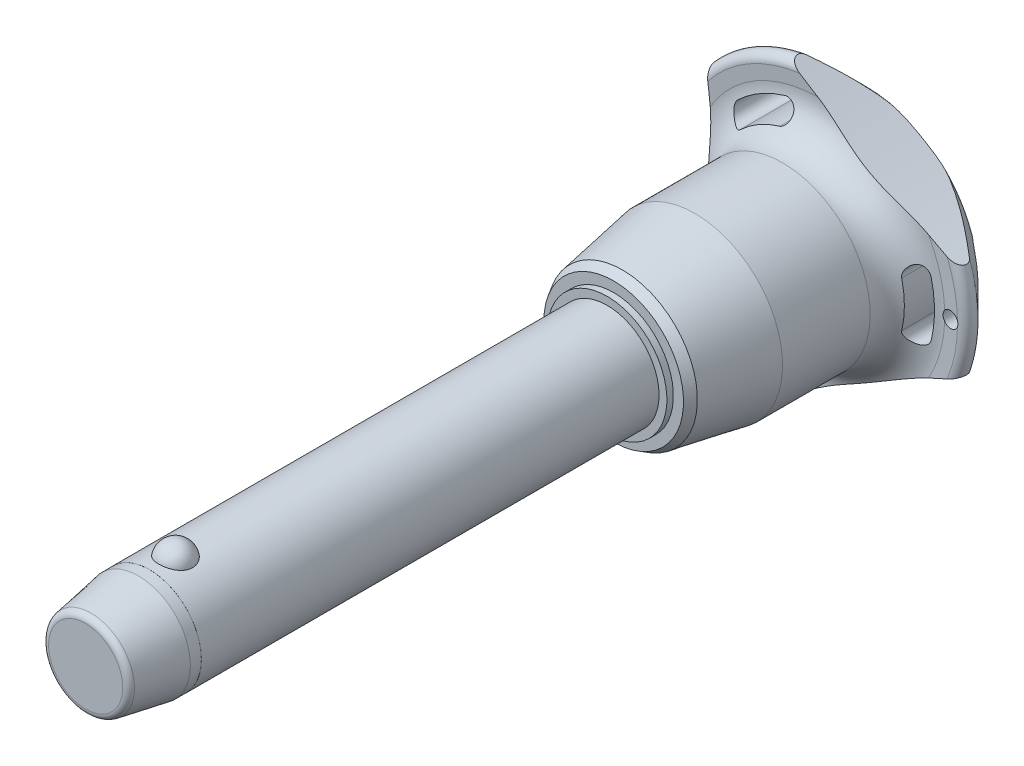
from build123d import *

# Parameters (mm, degrees)
SKETCH1_R           = 10
BOSS_EXTRUDE1_DEPTH = 80
SKETCH2_R           = 8.75
BOSS_EXTRUDE2_DEPTH = 50.7
BOSS_EXTRUDE3_START = 20.5
SKETCH1_2_R         = 10
BOSS_EXTRUDE3_DEPTH = 20.5
CHAMFER1_SIZE       = 10.25
CHAMFER1_SIZE2      = 1.807351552
FILLET1_R           = 1.25
SKETCH6_R           = 176.92625
CUT_EXTRUDE1_DEPTH  = 137.79481676
CIRPATTERN1_COUNT   = 3
SKETCH7_R           = 1.5
CUT_EXTRUDE2_DEPTH  = 137.683489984
SKETCH8_R           = 10
SKETCH8_R_2         = 9.99
CUT_EXTRUDE3_DEPTH  = 12.3


with BuildPart() as part:
    # Sketch1 → Boss-Extrude1 (new body)
    with BuildSketch(Plane.XY):
        Circle(SKETCH1_R)
    extrude(amount=-BOSS_EXTRUDE1_DEPTH)

    # Sketch2 → Boss-Extrude2 (add)
    with BuildSketch(Plane(origin=(0, 0, -80), x_dir=(-1, 0, 0), z_dir=(0, 0, -1))):
        with Locations(Location((0, 0, 0), (0, 0, 180))):
            Circle(SKETCH2_R)
    extrude(amount=BOSS_EXTRUDE2_DEPTH)

    # Sketch3 → Revolve1 (revolve)
    with BuildSketch(Plane(origin=(0, 0, 0), x_dir=(0, 0, -1), z_dir=(1, 0, 0))):
        with BuildLine():
            Line((-3.201562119, 12.5), (-3.201562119, 5.9))
            ThreePointArc((-3.201562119, 5.9), (0.098437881, 9.2), (-3.201562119, 12.5))
        make_face()
        with BuildLine():
            Line((-3.201562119, -5.9), (-3.201562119, -12.5))
            ThreePointArc((-3.201562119, -12.5), (0.098437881, -9.2), (-3.201562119, -5.9))
        make_face()
    revolve(axis=Axis((0, -5.9, 3.201562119), (0, 1, 0)))

    # Sketch1_2 → Boss-Extrude3 (add)
    with BuildSketch(Plane.XY.offset(BOSS_EXTRUDE3_START)):
        Circle(SKETCH1_2_R)
    extrude(amount=-BOSS_EXTRUDE3_DEPTH)

    # Chamfer1
    chamfer1_edges = [part.edges().sort_by_distance(p)[0] for p in [
        (-10, 0, 20.5),
    ]]
    chamfer1_side = [part.faces().sort_by_distance(p)[0] for p in [
        (-10, 0, -29.75),
    ]]
    chamfer(chamfer1_edges, length=CHAMFER1_SIZE, length2=CHAMFER1_SIZE2, reference=chamfer1_side[0])

    # Fillet1
    fillet1_edges = [part.edges().sort_by_distance(p)[0] for p in [
        (-8.192648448, 0, 20.5),
        (-8.75, 0, -130.7),
    ]]
    fillet(fillet1_edges, radius=FILLET1_R)

    # Sketch4 → Revolve2 (revolve)
    with BuildSketch(Plane(origin=(0, 0, 0), x_dir=(0, 0, -1), z_dir=(1, 0, 0)), mode=Mode.PRIVATE) as revolve2_sk:
        Polygon((80, 0), (80, 11.504815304), (81.25, 11.504815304), (81.25, 13.461079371), (82.944174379, 14.439211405), (96.9, 16.9), (113.8, 16.9), (113.8, 0), align=None)
    revolve(revolve2_sk.sketch.rotate(Axis((0, 0, -113.8), (0, 0, 1)), 90), axis=Axis((0, 0, -113.8), (0, 0, 1)))

    # Sketch5 → Revolve3 (revolve)
    with BuildSketch(Plane(origin=(0, 0, 0), x_dir=(0, 0, -1), z_dir=(1, 0, 0)), mode=Mode.PRIVATE) as revolve3_sk:
        with BuildLine():
            Line((120.790129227, 24.271609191), (120.652256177, 26.865060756))
            ThreePointArc((120.652256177, 26.865060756), (121.598671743, 28.411427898), (123.38137085, 28.08137085))
            Line((123.38137085, 28.08137085), (129.763226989, 21.69951471))
            ThreePointArc((129.763226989, 21.69951471), (130.7, 19.381044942), (129.683055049, 17.096604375))
            ThreePointArc((129.683055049, 17.096604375), (124.18864484, 9.321268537), (122.25, 0))
            Line((122.25, 0), (113.8, 0))
            Line((113.8, 0), (113.8, 16.9))
            ThreePointArc((113.8, 16.9), (118.879432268, 19.083427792), (120.790129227, 24.271609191))
        make_face()
    revolve(revolve3_sk.sketch.rotate(Axis((0, 0, -122.25), (0, 0, 1)), 90), axis=Axis((0, 0, -122.25), (0, 0, 1)))

    # Sketch6 → Cut-Extrude1 (cut, through all)
    with BuildSketch(Plane.XY):
        with Locations((-197.42625, 0)):
            Circle(SKETCH6_R)
        with BuildLine():
            ThreePointArc((21.802992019, -5.260839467), (22.428706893, 0), (21.802992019, 5.260839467))
            ThreePointArc((21.802992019, 5.260839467), (19.579234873, 6.620060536), (18.220013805, 4.39630339))
            ThreePointArc((18.220013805, 4.39630339), (18.742902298, 0), (18.220013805, -4.39630339))
            ThreePointArc((18.220013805, -4.39630339), (19.579234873, -6.620060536), (21.802992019, -5.260839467))
        make_face()
    cut_extrude1 = extrude(amount=-CUT_EXTRUDE1_DEPTH, mode=Mode.SUBTRACT)

    # CirPattern1: Cut-Extrude1 ×3 about axis
    cirpattern1_axis = Axis((0, 0, 0), (0, 0, 1))
    for i in range(1, CIRPATTERN1_COUNT):
        add(cut_extrude1.rotate(cirpattern1_axis, i * 360 / CIRPATTERN1_COUNT), mode=Mode.SUBTRACT)

    # Sketch7 → Cut-Extrude2 (cut, through all)
    with BuildSketch(Plane.XY):
        with Locations(Location((25.428706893, 0, 0), (0, 0, 17.230769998))):
            Circle(SKETCH7_R)
    extrude(amount=-CUT_EXTRUDE2_DEPTH, mode=Mode.SUBTRACT)

    # Sketch8 → Cut-Extrude3 (cut)
    with BuildSketch(Plane.XY.offset(20.5)):
        Circle(SKETCH8_R)
        Circle(SKETCH8_R_2, mode=Mode.SUBTRACT)
    extrude(amount=-CUT_EXTRUDE3_DEPTH, mode=Mode.SUBTRACT)


solid = part.part
